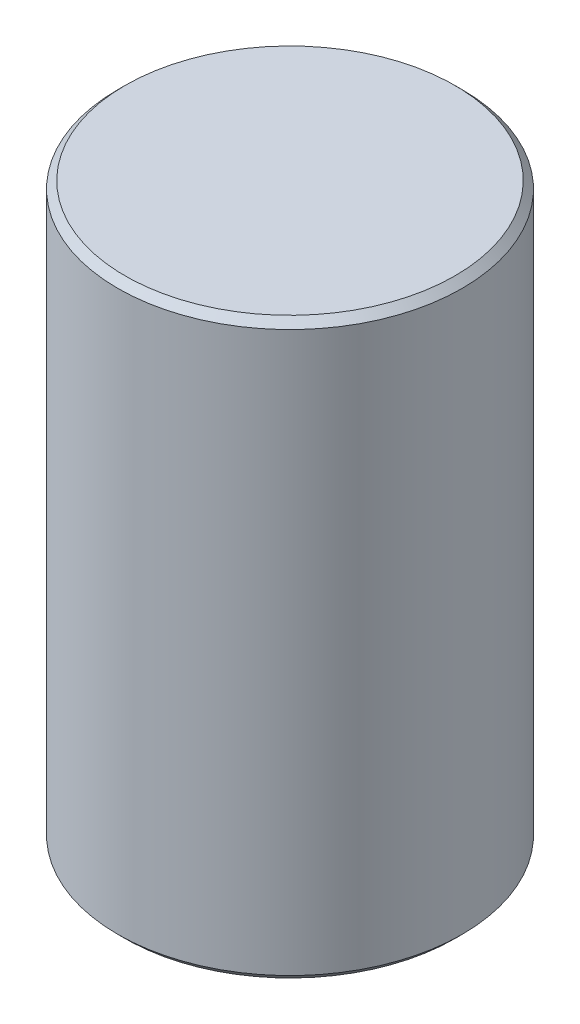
from build123d import *

# Parameters (mm, degrees)
SKETCH1_W                   = 38.1
SKETCH1_H                   = 127
CHAMFER1_SIZE               = 1.6002
F_5_8_11_TAPPED_HOLE1_D     = 13.49248
F_5_8_11_TAPPED_HOLE1_DEPTH = 38.6842
F_5_8_11_TAPPED_HOLE1_TIP   = 4.053549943


with BuildPart() as part:
    # Sketch1 → Revolve1 (revolve)
    with BuildSketch(Plane.XY, mode=Mode.PRIVATE) as revolve1_sk:
        with Locations((19.05, 63.5)):
            Rectangle(SKETCH1_W, SKETCH1_H)
    revolve(revolve1_sk.sketch.rotate(Axis((0, 127, 0), (0, -1, 0)), 180), axis=Axis((0, 127, 0), (0, -1, 0)))

    # Chamfer1
    chamfer1_edges = [part.edges().sort_by_distance(p)[0] for p in [
        (38.1, 0, 0),
        (38.1, 127, 0),
    ]]
    chamfer(chamfer1_edges, length=CHAMFER1_SIZE)

    # 5_8-11 Tapped Hole1
    with Locations(Plane(origin=(0, 0, 0), x_dir=(-1, 0, 0), z_dir=(0, -1, 0))):
        with Locations((0, 0)):
            Hole(F_5_8_11_TAPPED_HOLE1_D / 2, depth=F_5_8_11_TAPPED_HOLE1_DEPTH)
            with Locations((0, 0, -(F_5_8_11_TAPPED_HOLE1_DEPTH + F_5_8_11_TAPPED_HOLE1_TIP / 2))):  # 118° drill point
                Cone(0, F_5_8_11_TAPPED_HOLE1_D / 2, F_5_8_11_TAPPED_HOLE1_TIP, mode=Mode.SUBTRACT)


solid = part.part
